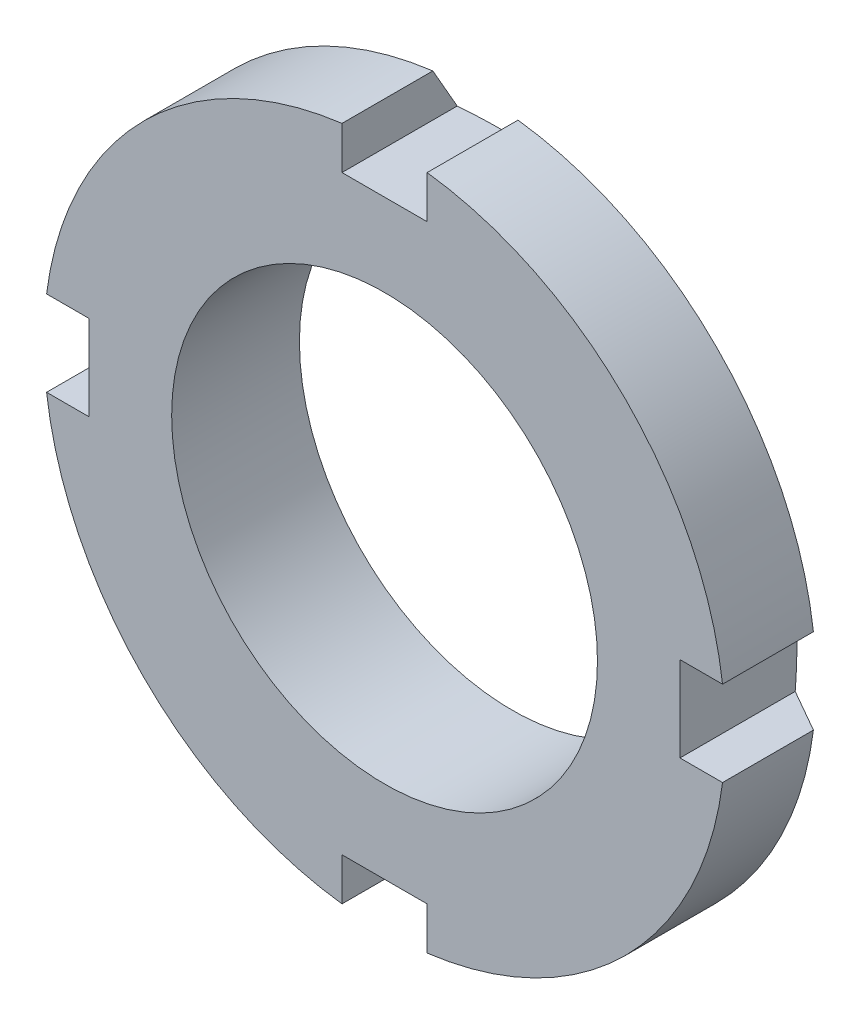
ISO-10303-21;
HEADER;
FILE_DESCRIPTION(('STEP AP214'),'2;1');
FILE_NAME('part.step','',(''),(''),'','','');
FILE_SCHEMA(('AUTOMOTIVE_DESIGN { 1 0 10303 214 1 1 1 1 }'));
ENDSEC;
DATA;
#1=APPLICATION_CONTEXT('core data for automotive mechanical design processes');
#2=APPLICATION_PROTOCOL_DEFINITION('international standard','automotive_design',2000,#1);
#3=PRODUCT_CONTEXT('',#1,'mechanical');
#4=PRODUCT('Part','Part','',(#3));
#5=PRODUCT_RELATED_PRODUCT_CATEGORY('part','',(#4));
#6=PRODUCT_DEFINITION_FORMATION('','',#4);
#7=PRODUCT_DEFINITION_CONTEXT('part definition',#1,'design');
#8=PRODUCT_DEFINITION('design','',#6,#7);
#9=PRODUCT_DEFINITION_SHAPE('','',#8);
#10=(LENGTH_UNIT() NAMED_UNIT(*) SI_UNIT(.MILLI.,.METRE.));
#11=(NAMED_UNIT(*) PLANE_ANGLE_UNIT() SI_UNIT($,.RADIAN.));
#12=(NAMED_UNIT(*) SI_UNIT($,.STERADIAN.) SOLID_ANGLE_UNIT());
#13=UNCERTAINTY_MEASURE_WITH_UNIT(LENGTH_MEASURE(1.E-05),#10,'distance_accuracy_value','');
#14=(GEOMETRIC_REPRESENTATION_CONTEXT(3) GLOBAL_UNCERTAINTY_ASSIGNED_CONTEXT((#13)) GLOBAL_UNIT_ASSIGNED_CONTEXT((#10,
#11,#12)) REPRESENTATION_CONTEXT('',''));
#15=CARTESIAN_POINT('',(0.,0.,0.));
#16=DIRECTION('',(0.,0.,1.));
#17=DIRECTION('',(1.,0.,0.));
#18=AXIS2_PLACEMENT_3D('',#15,#16,#17);
#19=CARTESIAN_POINT('',(0.,0.,0.));
#20=DIRECTION('',(0.,0.,-1.));
#21=DIRECTION('',(-1.,0.,0.));
#22=AXIS2_PLACEMENT_3D('',#19,#20,#21);
#23=CYLINDRICAL_SURFACE('',#22,16.);
#24=DIRECTION('',(0.,0.,-1.));
#25=VECTOR('',#24,1.);
#26=CARTESIAN_POINT('',(-2.,15.8745078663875,5.99999999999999));
#27=LINE('',#26,#25);
#28=CARTESIAN_POINT('',(-2.,15.8745078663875,5.99999999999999));
#29=VERTEX_POINT('',#28);
#30=CARTESIAN_POINT('',(-2.,15.8745078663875,1.73205080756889));
#31=VERTEX_POINT('',#30);
#32=EDGE_CURVE('E148',#29,#31,#27,.T.);
#33=ORIENTED_EDGE('',*,*,#32,.T.);
#34=CARTESIAN_POINT('',(0.,0.,1.73205080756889));
#35=DIRECTION('',(0.,0.,-1.));
#36=DIRECTION('',(-1.,0.,0.));
#37=AXIS2_PLACEMENT_3D('',#34,#35,#36);
#38=CIRCLE('',#37,16.);
#39=CARTESIAN_POINT('',(-15.8745078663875,2.,1.73205080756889));
#40=VERTEX_POINT('',#39);
#41=EDGE_CURVE('E185',#40,#31,#38,.T.);
#42=ORIENTED_EDGE('',*,*,#41,.F.);
#43=DIRECTION('',(0.,0.,-1.));
#44=VECTOR('',#43,1.);
#45=CARTESIAN_POINT('',(-15.8745078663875,2.,5.99999999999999));
#46=LINE('',#45,#44);
#47=CARTESIAN_POINT('',(-15.8745078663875,2.,5.99999999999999));
#48=VERTEX_POINT('',#47);
#49=EDGE_CURVE('E161',#48,#40,#46,.T.);
#50=ORIENTED_EDGE('',*,*,#49,.F.);
#51=CARTESIAN_POINT('',(0.,0.,5.99999999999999));
#52=DIRECTION('',(0.,0.,-1.));
#53=DIRECTION('',(-1.,0.,0.));
#54=AXIS2_PLACEMENT_3D('',#51,#52,#53);
#55=CIRCLE('',#54,16.);
#56=EDGE_CURVE('E168',#48,#29,#55,.T.);
#57=ORIENTED_EDGE('',*,*,#56,.T.);
#58=EDGE_LOOP('',(#33,#42,#50,#57));
#59=FACE_BOUND('',#58,.T.);
#60=ADVANCED_FACE('F32',(#59),#23,.T.);
#61=DIRECTION('',(0.,0.,-1.));
#62=VECTOR('',#61,1.);
#63=CARTESIAN_POINT('',(-15.8745078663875,-2.,5.99999999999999));
#64=LINE('',#63,#62);
#65=CARTESIAN_POINT('',(-15.8745078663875,-2.,5.99999999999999));
#66=VERTEX_POINT('',#65);
#67=CARTESIAN_POINT('',(-15.8745078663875,-2.,1.73205080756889));
#68=VERTEX_POINT('',#67);
#69=EDGE_CURVE('E339',#66,#68,#64,.T.);
#70=ORIENTED_EDGE('',*,*,#69,.T.);
#71=CARTESIAN_POINT('',(-2.,-15.8745078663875,1.73205080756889));
#72=VERTEX_POINT('',#71);
#73=EDGE_CURVE('E191',#72,#68,#38,.T.);
#74=ORIENTED_EDGE('',*,*,#73,.F.);
#75=DIRECTION('',(0.,0.,-1.));
#76=VECTOR('',#75,1.);
#77=CARTESIAN_POINT('',(-2.,-15.8745078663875,5.99999999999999));
#78=LINE('',#77,#76);
#79=CARTESIAN_POINT('',(-2.,-15.8745078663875,5.99999999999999));
#80=VERTEX_POINT('',#79);
#81=EDGE_CURVE('E313',#80,#72,#78,.T.);
#82=ORIENTED_EDGE('',*,*,#81,.F.);
#83=EDGE_CURVE('E178',#80,#66,#55,.T.);
#84=ORIENTED_EDGE('',*,*,#83,.T.);
#85=EDGE_LOOP('',(#70,#74,#82,#84));
#86=FACE_BOUND('',#85,.T.);
#87=ADVANCED_FACE('F394',(#86),#23,.T.);
#88=DIRECTION('',(0.,0.,-1.));
#89=VECTOR('',#88,1.);
#90=CARTESIAN_POINT('',(1.99999999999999,-15.8745078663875,5.99999999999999));
#91=LINE('',#90,#89);
#92=CARTESIAN_POINT('',(1.99999999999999,-15.8745078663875,5.99999999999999));
#93=VERTEX_POINT('',#92);
#94=CARTESIAN_POINT('',(2.,-15.8745078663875,1.73205080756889));
#95=VERTEX_POINT('',#94);
#96=EDGE_CURVE('E329',#93,#95,#91,.T.);
#97=ORIENTED_EDGE('',*,*,#96,.T.);
#98=CARTESIAN_POINT('',(15.8745078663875,-2.,1.73205080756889));
#99=VERTEX_POINT('',#98);
#100=EDGE_CURVE('E195',#99,#95,#38,.T.);
#101=ORIENTED_EDGE('',*,*,#100,.F.);
#102=DIRECTION('',(0.,0.,-1.));
#103=VECTOR('',#102,1.);
#104=CARTESIAN_POINT('',(15.8745078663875,-2.,5.99999999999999));
#105=LINE('',#104,#103);
#106=CARTESIAN_POINT('',(15.8745078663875,-2.,5.99999999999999));
#107=VERTEX_POINT('',#106);
#108=EDGE_CURVE('E327',#107,#99,#105,.T.);
#109=ORIENTED_EDGE('',*,*,#108,.F.);
#110=EDGE_CURVE('E182',#107,#93,#55,.T.);
#111=ORIENTED_EDGE('',*,*,#110,.T.);
#112=EDGE_LOOP('',(#97,#101,#109,#111));
#113=FACE_BOUND('',#112,.T.);
#114=ADVANCED_FACE('F326',(#113),#23,.T.);
#115=CARTESIAN_POINT('',(0.,0.,0.));
#116=DIRECTION('',(0.,0.,1.));
#117=DIRECTION('',(1.,0.,0.));
#118=AXIS2_PLACEMENT_3D('',#115,#116,#117);
#119=CONICAL_SURFACE('',#118,13.,1.0471975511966);
#120=CARTESIAN_POINT('',(-19.8478725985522,2.,4.01165169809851));
#121=CARTESIAN_POINT('',(-19.1389411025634,2.,3.60443009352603));
#122=CARTESIAN_POINT('',(-18.4299294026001,2.,3.19734788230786));
#123=CARTESIAN_POINT('',(-17.0116378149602,2.,2.3836527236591));
#124=CARTESIAN_POINT('',(-16.3023579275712,2.,1.97703977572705));
#125=CARTESIAN_POINT('',(-14.8834201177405,2.,1.16447243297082));
#126=CARTESIAN_POINT('',(-14.1737621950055,2.,0.758518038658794));
#127=CARTESIAN_POINT('',(-13.1088352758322,2.,0.150355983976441));
#128=CARTESIAN_POINT('',(-12.753786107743,2.,-0.0522365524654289));
#129=CARTESIAN_POINT('',(-12.043496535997,2.,-0.457086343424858));
#130=CARTESIAN_POINT('',(-11.6882561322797,2.,-0.659343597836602));
#131=CARTESIAN_POINT('',(-11.3328978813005,2.,-0.861393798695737));
#132=B_SPLINE_CURVE_WITH_KNOTS('',3,(#120,#121,#122,#123,#124,#125,#126,#127,#128,#129,#130,
#131),.UNSPECIFIED.,.F.,.F.,(4,2,2,2,2,4),(0.,2.45269656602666,4.90539050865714,
7.35808635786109,8.58443558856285,9.81078520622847),.UNSPECIFIED.);
#133=CARTESIAN_POINT('',(-13.8745078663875,2.,0.587694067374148));
#134=VERTEX_POINT('',#133);
#135=EDGE_CURVE('E234',#40,#134,#132,.T.);
#136=ORIENTED_EDGE('',*,*,#135,.F.);
#137=ORIENTED_EDGE('',*,*,#41,.T.);
#138=CARTESIAN_POINT('',(-2.,9.8264067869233,-1.715957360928));
#139=CARTESIAN_POINT('',(-2.,10.1821927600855,-1.51465946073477));
#140=CARTESIAN_POINT('',(-2.,10.5378027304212,-1.31305098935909));
#141=CARTESIAN_POINT('',(-2.,11.2487432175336,-0.909342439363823));
#142=CARTESIAN_POINT('',(-2.,11.604073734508,-0.70724236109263));
#143=CARTESIAN_POINT('',(-2.,12.6697542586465,-0.10039940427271));
#144=CARTESIAN_POINT('',(-2.,13.3797946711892,0.304887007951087));
#145=CARTESIAN_POINT('',(-2.,14.7993681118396,1.11634418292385));
#146=CARTESIAN_POINT('',(-2.,15.5089011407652,1.52251494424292));
#147=CARTESIAN_POINT('',(-2.,16.9276181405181,2.33546903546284));
#148=CARTESIAN_POINT('',(-2.,17.6368021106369,2.74225236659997));
#149=CARTESIAN_POINT('',(-2.,18.3458887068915,3.1492049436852));
#150=B_SPLINE_CURVE_WITH_KNOTS('',3,(#138,#139,#140,#141,#142,#143,#144,#145,#146,#147,#148,
#149),.UNSPECIFIED.,.F.,.F.,(4,2,2,2,2,4),(0.,1.22635201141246,2.4527031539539,4.90540050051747,
7.35809388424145,9.81079222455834),.UNSPECIFIED.);
#151=CARTESIAN_POINT('',(-2.,13.8745078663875,0.587694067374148));
#152=VERTEX_POINT('',#151);
#153=EDGE_CURVE('E155',#152,#31,#150,.T.);
#154=ORIENTED_EDGE('',*,*,#153,.F.);
#155=CARTESIAN_POINT('',(6.04182336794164,13.8745078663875,1.23144823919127));
#156=CARTESIAN_POINT('',(5.73063061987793,13.8745078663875,1.1597083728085));
#157=CARTESIAN_POINT('',(5.41838778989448,13.8745078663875,1.09239925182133));
#158=CARTESIAN_POINT('',(4.79189692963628,13.8745078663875,0.967500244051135));
#159=CARTESIAN_POINT('',(4.47764847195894,13.8745078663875,0.909912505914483));
#160=CARTESIAN_POINT('',(3.84704148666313,13.8745078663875,0.80529047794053));
#161=CARTESIAN_POINT('',(3.530681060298,13.8745078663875,0.758267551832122));
#162=CARTESIAN_POINT('',(2.89648649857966,13.8745078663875,0.675648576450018));
#163=CARTESIAN_POINT('',(2.57865246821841,13.8745078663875,0.640051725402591));
#164=CARTESIAN_POINT('',(1.94839121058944,13.8745078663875,0.581544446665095));
#165=CARTESIAN_POINT('',(1.6359868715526,13.8745078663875,0.558388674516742));
#166=CARTESIAN_POINT('',(1.01051204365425,13.8745078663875,0.524103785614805));
#167=CARTESIAN_POINT('',(0.697441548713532,13.8745078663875,0.512974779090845));
#168=CARTESIAN_POINT('',(0.0713288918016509,13.8745078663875,0.502967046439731));
#169=CARTESIAN_POINT('',(-0.241713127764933,13.8745078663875,0.504079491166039));
#170=CARTESIAN_POINT('',(-0.867515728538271,13.8745078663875,0.518509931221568));
#171=CARTESIAN_POINT('',(-1.18027630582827,13.8745078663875,0.531828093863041));
#172=CARTESIAN_POINT('',(-1.85622061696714,13.8745078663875,0.573574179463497));
#173=CARTESIAN_POINT('',(-2.21927454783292,13.8745078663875,0.604119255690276));
#174=CARTESIAN_POINT('',(-2.94375306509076,13.8745078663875,0.680629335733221));
#175=CARTESIAN_POINT('',(-3.30517758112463,13.8745078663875,0.726594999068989));
#176=CARTESIAN_POINT('',(-4.02634188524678,13.8745078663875,0.832945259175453));
#177=CARTESIAN_POINT('',(-4.38607903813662,13.8745078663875,0.893347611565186));
#178=CARTESIAN_POINT('',(-5.10310224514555,13.8745078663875,1.02729500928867));
#179=CARTESIAN_POINT('',(-5.460388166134,13.8745078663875,1.10084076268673));
#180=CARTESIAN_POINT('',(-6.18125690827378,13.8745078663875,1.26174599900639));
#181=CARTESIAN_POINT('',(-6.54477225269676,13.8745078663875,1.34940624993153));
#182=CARTESIAN_POINT('',(-7.26898372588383,13.8745078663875,1.53574081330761));
#183=CARTESIAN_POINT('',(-7.62967964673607,13.8745078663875,1.63441592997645));
#184=CARTESIAN_POINT('',(-8.34718971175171,13.8745078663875,1.84112295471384));
#185=CARTESIAN_POINT('',(-8.70401227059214,13.8745078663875,1.94912581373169));
#186=CARTESIAN_POINT('',(-9.41490810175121,13.8745078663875,2.17353445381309));
#187=CARTESIAN_POINT('',(-9.76898206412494,13.8745078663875,2.28993804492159));
#188=CARTESIAN_POINT('',(-10.121791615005,13.8745078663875,2.40996689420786));
#189=B_SPLINE_CURVE_WITH_KNOTS('',3,(#155,#156,#157,#158,#159,#160,#161,#162,#163,#164,#165,
#166,#167,#168,#169,#170,#171,#172,#173,#174,#175,#176,#177,#178,#179,#180,#181,#182,#183,#184,
#185,#186,#187,#188),.UNSPECIFIED.,.F.,.F.,(4,2,2,2,2,2,2,2,2,2,2,2,2,2,2,2,4),(0.,
0.958073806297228,1.9163590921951,2.87567024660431,3.83491407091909,4.77447354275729,
5.71404162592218,6.65293209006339,7.59183542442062,8.68448802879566,9.77718737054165,
10.8712375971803,11.9653467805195,13.0869589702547,14.2086531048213,15.3269719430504,
16.4450002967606),.UNSPECIFIED.);
#190=CARTESIAN_POINT('',(2.,13.8745078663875,0.587694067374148));
#191=VERTEX_POINT('',#190);
#192=EDGE_CURVE('E248',#191,#152,#189,.T.);
#193=ORIENTED_EDGE('',*,*,#192,.F.);
#194=CARTESIAN_POINT('',(2.,18.3458887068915,3.1492049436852));
#195=CARTESIAN_POINT('',(2.,17.6368021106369,2.74225236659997));
#196=CARTESIAN_POINT('',(2.,16.9276181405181,2.33546903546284));
#197=CARTESIAN_POINT('',(2.,15.5089011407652,1.52251494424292));
#198=CARTESIAN_POINT('',(2.,14.7993681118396,1.11634418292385));
#199=CARTESIAN_POINT('',(2.,13.3797946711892,0.304887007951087));
#200=CARTESIAN_POINT('',(2.,12.6697542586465,-0.10039940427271));
#201=CARTESIAN_POINT('',(2.,11.604073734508,-0.707242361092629));
#202=CARTESIAN_POINT('',(2.,11.2487432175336,-0.909342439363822));
#203=CARTESIAN_POINT('',(2.,10.5378027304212,-1.31305098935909));
#204=CARTESIAN_POINT('',(2.,10.1821927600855,-1.51465946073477));
#205=CARTESIAN_POINT('',(2.,9.8264067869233,-1.715957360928));
#206=B_SPLINE_CURVE_WITH_KNOTS('',3,(#194,#195,#196,#197,#198,#199,#200,#201,#202,#203,#204,
#205),.UNSPECIFIED.,.F.,.F.,(4,2,2,2,2,4),(0.,2.45269834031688,4.90539172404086,
7.35808907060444,8.58444021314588,9.81079222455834),.UNSPECIFIED.);
#207=CARTESIAN_POINT('',(2.,15.8745078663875,1.73205080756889));
#208=VERTEX_POINT('',#207);
#209=EDGE_CURVE('E160',#208,#191,#206,.T.);
#210=ORIENTED_EDGE('',*,*,#209,.F.);
#211=CARTESIAN_POINT('',(15.8745078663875,2.,1.73205080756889));
#212=VERTEX_POINT('',#211);
#213=EDGE_CURVE('E190',#208,#212,#38,.T.);
#214=ORIENTED_EDGE('',*,*,#213,.T.);
#215=CARTESIAN_POINT('',(9.8264067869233,2.,-1.715957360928));
#216=CARTESIAN_POINT('',(10.1821927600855,2.,-1.51465946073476));
#217=CARTESIAN_POINT('',(10.5378027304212,2.,-1.31305098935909));
#218=CARTESIAN_POINT('',(11.2487432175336,2.,-0.909342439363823));
#219=CARTESIAN_POINT('',(11.604073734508,2.,-0.70724236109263));
#220=CARTESIAN_POINT('',(12.6697542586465,2.,-0.100399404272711));
#221=CARTESIAN_POINT('',(13.3797946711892,2.,0.304887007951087));
#222=CARTESIAN_POINT('',(14.7993681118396,2.,1.11634418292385));
#223=CARTESIAN_POINT('',(15.5089011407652,2.,1.52251494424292));
#224=CARTESIAN_POINT('',(16.9276181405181,2.,2.33546903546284));
#225=CARTESIAN_POINT('',(17.6368021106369,2.,2.74225236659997));
#226=CARTESIAN_POINT('',(18.3458887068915,2.,3.1492049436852));
#227=B_SPLINE_CURVE_WITH_KNOTS('',3,(#215,#216,#217,#218,#219,#220,#221,#222,#223,#224,#225,
#226),.UNSPECIFIED.,.F.,.F.,(4,2,2,2,2,4),(0.,1.22635201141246,2.4527031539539,4.90540050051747,
7.35809388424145,9.81079222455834),.UNSPECIFIED.);
#228=CARTESIAN_POINT('',(13.8745078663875,2.,0.587694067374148));
#229=VERTEX_POINT('',#228);
#230=EDGE_CURVE('E274',#229,#212,#227,.T.);
#231=ORIENTED_EDGE('',*,*,#230,.F.);
#232=CARTESIAN_POINT('',(13.8745078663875,-10.121791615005,2.40996689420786));
#233=CARTESIAN_POINT('',(13.8745078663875,-9.76898206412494,2.28993804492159));
#234=CARTESIAN_POINT('',(13.8745078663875,-9.41490810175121,2.17353445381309));
#235=CARTESIAN_POINT('',(13.8745078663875,-8.70401227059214,1.94912581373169));
#236=CARTESIAN_POINT('',(13.8745078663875,-8.34718971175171,1.84112295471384));
#237=CARTESIAN_POINT('',(13.8745078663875,-7.62967964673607,1.63441592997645));
#238=CARTESIAN_POINT('',(13.8745078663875,-7.26898372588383,1.53574081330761));
#239=CARTESIAN_POINT('',(13.8745078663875,-6.54477225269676,1.34940624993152));
#240=CARTESIAN_POINT('',(13.8745078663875,-6.18125690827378,1.26174599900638));
#241=CARTESIAN_POINT('',(13.8745078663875,-5.460388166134,1.10084076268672));
#242=CARTESIAN_POINT('',(13.8745078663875,-5.10310224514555,1.02729500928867));
#243=CARTESIAN_POINT('',(13.8745078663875,-4.38607903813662,0.893347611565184));
#244=CARTESIAN_POINT('',(13.8745078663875,-4.02634188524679,0.832945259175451));
#245=CARTESIAN_POINT('',(13.8745078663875,-3.30517758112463,0.726594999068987));
#246=CARTESIAN_POINT('',(13.8745078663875,-2.94375306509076,0.680629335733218));
#247=CARTESIAN_POINT('',(13.8745078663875,-2.21927454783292,0.604119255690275));
#248=CARTESIAN_POINT('',(13.8745078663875,-1.85622061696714,0.573574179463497));
#249=CARTESIAN_POINT('',(13.8745078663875,-1.18027630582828,0.531828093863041));
#250=CARTESIAN_POINT('',(13.8745078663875,-0.867515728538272,0.518509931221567));
#251=CARTESIAN_POINT('',(13.8745078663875,-0.241713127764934,0.504079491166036));
#252=CARTESIAN_POINT('',(13.8745078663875,0.0713288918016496,0.502967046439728));
#253=CARTESIAN_POINT('',(13.8745078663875,0.697441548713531,0.512974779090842));
#254=CARTESIAN_POINT('',(13.8745078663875,1.01051204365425,0.524103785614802));
#255=CARTESIAN_POINT('',(13.8745078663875,1.6359868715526,0.558388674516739));
#256=CARTESIAN_POINT('',(13.8745078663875,1.94839121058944,0.581544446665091));
#257=CARTESIAN_POINT('',(13.8745078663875,2.57865246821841,0.640051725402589));
#258=CARTESIAN_POINT('',(13.8745078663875,2.89648649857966,0.675648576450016));
#259=CARTESIAN_POINT('',(13.8745078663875,3.530681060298,0.75826755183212));
#260=CARTESIAN_POINT('',(13.8745078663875,3.84704148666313,0.805290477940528));
#261=CARTESIAN_POINT('',(13.8745078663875,4.47764847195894,0.90991250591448));
#262=CARTESIAN_POINT('',(13.8745078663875,4.79189692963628,0.967500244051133));
#263=CARTESIAN_POINT('',(13.8745078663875,5.41838778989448,1.09239925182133));
#264=CARTESIAN_POINT('',(13.8745078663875,5.73063061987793,1.1597083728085));
#265=CARTESIAN_POINT('',(13.8745078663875,6.04182336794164,1.23144823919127));
#266=B_SPLINE_CURVE_WITH_KNOTS('',3,(#232,#233,#234,#235,#236,#237,#238,#239,#240,#241,#242,
#243,#244,#245,#246,#247,#248,#249,#250,#251,#252,#253,#254,#255,#256,#257,#258,#259,#260,#261,
#262,#263,#264,#265),.UNSPECIFIED.,.F.,.F.,(4,2,2,2,2,2,2,2,2,2,2,2,2,2,2,2,4),(0.,
1.11802835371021,2.23634719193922,3.35804132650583,4.47965351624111,5.5737626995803,
6.66781292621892,7.7605122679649,8.85316487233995,9.79206820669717,10.7309586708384,
11.6705267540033,12.6100862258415,13.5693300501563,14.5286412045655,15.4869264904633,
16.4450002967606),.UNSPECIFIED.);
#267=CARTESIAN_POINT('',(13.8745078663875,-2.,0.587694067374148));
#268=VERTEX_POINT('',#267);
#269=EDGE_CURVE('E206',#268,#229,#266,.T.);
#270=ORIENTED_EDGE('',*,*,#269,.F.);
#271=CARTESIAN_POINT('',(18.3458887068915,-2.,3.1492049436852));
#272=CARTESIAN_POINT('',(17.6368021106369,-2.,2.74225236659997));
#273=CARTESIAN_POINT('',(16.9276181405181,-2.,2.33546903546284));
#274=CARTESIAN_POINT('',(15.5089011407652,-2.,1.52251494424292));
#275=CARTESIAN_POINT('',(14.7993681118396,-2.,1.11634418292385));
#276=CARTESIAN_POINT('',(13.3797946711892,-2.,0.304887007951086));
#277=CARTESIAN_POINT('',(12.6697542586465,-2.,-0.10039940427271));
#278=CARTESIAN_POINT('',(11.604073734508,-2.,-0.707242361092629));
#279=CARTESIAN_POINT('',(11.2487432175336,-2.,-0.909342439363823));
#280=CARTESIAN_POINT('',(10.5378027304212,-2.,-1.31305098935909));
#281=CARTESIAN_POINT('',(10.1821927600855,-2.,-1.51465946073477));
#282=CARTESIAN_POINT('',(9.8264067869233,-2.,-1.715957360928));
#283=B_SPLINE_CURVE_WITH_KNOTS('',3,(#271,#272,#273,#274,#275,#276,#277,#278,#279,#280,#281,
#282),.UNSPECIFIED.,.F.,.F.,(4,2,2,2,2,4),(0.,2.45269834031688,4.90539172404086,
7.35808907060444,8.58444021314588,9.81079222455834),.UNSPECIFIED.);
#284=EDGE_CURVE('E280',#99,#268,#283,.T.);
#285=ORIENTED_EDGE('',*,*,#284,.F.);
#286=ORIENTED_EDGE('',*,*,#100,.T.);
#287=CARTESIAN_POINT('',(2.,-11.3328978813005,-0.861393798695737));
#288=CARTESIAN_POINT('',(2.,-11.6882561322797,-0.659343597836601));
#289=CARTESIAN_POINT('',(2.,-12.043496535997,-0.457086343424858));
#290=CARTESIAN_POINT('',(2.,-12.753786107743,-0.0522365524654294));
#291=CARTESIAN_POINT('',(2.,-13.1088352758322,0.15035598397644));
#292=CARTESIAN_POINT('',(2.,-14.1737621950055,0.758518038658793));
#293=CARTESIAN_POINT('',(2.,-14.8834201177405,1.16447243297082));
#294=CARTESIAN_POINT('',(2.,-16.3023579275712,1.97703977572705));
#295=CARTESIAN_POINT('',(2.,-17.0116378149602,2.3836527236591));
#296=CARTESIAN_POINT('',(2.,-18.4299294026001,3.19734788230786));
#297=CARTESIAN_POINT('',(2.,-19.1389411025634,3.60443009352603));
#298=CARTESIAN_POINT('',(2.,-19.8478725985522,4.01165169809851));
#299=B_SPLINE_CURVE_WITH_KNOTS('',3,(#287,#288,#289,#290,#291,#292,#293,#294,#295,#296,#297,
#298),.UNSPECIFIED.,.F.,.F.,(4,2,2,2,2,4),(0.,1.22634961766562,2.45269884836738,
4.90539469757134,7.35808864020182,9.81078520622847),.UNSPECIFIED.);
#300=CARTESIAN_POINT('',(2.,-13.8745078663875,0.587694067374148));
#301=VERTEX_POINT('',#300);
#302=EDGE_CURVE('E56',#301,#95,#299,.T.);
#303=ORIENTED_EDGE('',*,*,#302,.F.);
#304=CARTESIAN_POINT('',(-10.121791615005,-13.8745078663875,2.40996689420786));
#305=CARTESIAN_POINT('',(-9.76898206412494,-13.8745078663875,2.28993804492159));
#306=CARTESIAN_POINT('',(-9.41490810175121,-13.8745078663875,2.17353445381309));
#307=CARTESIAN_POINT('',(-8.70401227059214,-13.8745078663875,1.94912581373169));
#308=CARTESIAN_POINT('',(-8.34718971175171,-13.8745078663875,1.84112295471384));
#309=CARTESIAN_POINT('',(-7.62967964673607,-13.8745078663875,1.63441592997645));
#310=CARTESIAN_POINT('',(-7.26898372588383,-13.8745078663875,1.53574081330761));
#311=CARTESIAN_POINT('',(-6.54477225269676,-13.8745078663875,1.34940624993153));
#312=CARTESIAN_POINT('',(-6.18125690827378,-13.8745078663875,1.26174599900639));
#313=CARTESIAN_POINT('',(-5.460388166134,-13.8745078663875,1.10084076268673));
#314=CARTESIAN_POINT('',(-5.10310224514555,-13.8745078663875,1.02729500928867));
#315=CARTESIAN_POINT('',(-4.38607903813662,-13.8745078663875,0.893347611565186));
#316=CARTESIAN_POINT('',(-4.02634188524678,-13.8745078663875,0.832945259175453));
#317=CARTESIAN_POINT('',(-3.30517758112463,-13.8745078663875,0.726594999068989));
#318=CARTESIAN_POINT('',(-2.94375306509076,-13.8745078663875,0.680629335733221));
#319=CARTESIAN_POINT('',(-2.21927454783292,-13.8745078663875,0.604119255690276));
#320=CARTESIAN_POINT('',(-1.85622061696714,-13.8745078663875,0.573574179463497));
#321=CARTESIAN_POINT('',(-1.18027630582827,-13.8745078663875,0.531828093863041));
#322=CARTESIAN_POINT('',(-0.867515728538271,-13.8745078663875,0.518509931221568));
#323=CARTESIAN_POINT('',(-0.241713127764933,-13.8745078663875,0.504079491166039));
#324=CARTESIAN_POINT('',(0.071328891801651,-13.8745078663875,0.502967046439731));
#325=CARTESIAN_POINT('',(0.697441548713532,-13.8745078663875,0.512974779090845));
#326=CARTESIAN_POINT('',(1.01051204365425,-13.8745078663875,0.524103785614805));
#327=CARTESIAN_POINT('',(1.6359868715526,-13.8745078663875,0.558388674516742));
#328=CARTESIAN_POINT('',(1.94839121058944,-13.8745078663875,0.581544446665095));
#329=CARTESIAN_POINT('',(2.57865246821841,-13.8745078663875,0.640051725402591));
#330=CARTESIAN_POINT('',(2.89648649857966,-13.8745078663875,0.675648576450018));
#331=CARTESIAN_POINT('',(3.530681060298,-13.8745078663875,0.758267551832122));
#332=CARTESIAN_POINT('',(3.84704148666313,-13.8745078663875,0.80529047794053));
#333=CARTESIAN_POINT('',(4.47764847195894,-13.8745078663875,0.909912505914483));
#334=CARTESIAN_POINT('',(4.79189692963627,-13.8745078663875,0.967500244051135));
#335=CARTESIAN_POINT('',(5.41838778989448,-13.8745078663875,1.09239925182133));
#336=CARTESIAN_POINT('',(5.73063061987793,-13.8745078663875,1.1597083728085));
#337=CARTESIAN_POINT('',(6.04182336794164,-13.8745078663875,1.23144823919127));
#338=B_SPLINE_CURVE_WITH_KNOTS('',3,(#304,#305,#306,#307,#308,#309,#310,#311,#312,#313,#314,
#315,#316,#317,#318,#319,#320,#321,#322,#323,#324,#325,#326,#327,#328,#329,#330,#331,#332,#333,
#334,#335,#336,#337),.UNSPECIFIED.,.F.,.F.,(4,2,2,2,2,2,2,2,2,2,2,2,2,2,2,2,4),(0.,
1.11802835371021,2.23634719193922,3.35804132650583,4.47965351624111,5.5737626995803,
6.66781292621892,7.7605122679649,8.85316487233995,9.79206820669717,10.7309586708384,
11.6705267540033,12.6100862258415,13.5693300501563,14.5286412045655,15.4869264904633,
16.4450002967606),.UNSPECIFIED.);
#339=CARTESIAN_POINT('',(-2.,-13.8745078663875,0.587694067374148));
#340=VERTEX_POINT('',#339);
#341=EDGE_CURVE('E202',#340,#301,#338,.T.);
#342=ORIENTED_EDGE('',*,*,#341,.F.);
#343=CARTESIAN_POINT('',(-2.,-19.8478725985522,4.01165169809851));
#344=CARTESIAN_POINT('',(-2.,-19.1389411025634,3.60443009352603));
#345=CARTESIAN_POINT('',(-2.,-18.4299294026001,3.19734788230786));
#346=CARTESIAN_POINT('',(-2.,-17.0116378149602,2.3836527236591));
#347=CARTESIAN_POINT('',(-2.,-16.3023579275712,1.97703977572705));
#348=CARTESIAN_POINT('',(-2.,-14.8834201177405,1.16447243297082));
#349=CARTESIAN_POINT('',(-2.,-14.1737621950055,0.758518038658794));
#350=CARTESIAN_POINT('',(-2.,-13.1088352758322,0.150355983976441));
#351=CARTESIAN_POINT('',(-2.,-12.753786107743,-0.052236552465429));
#352=CARTESIAN_POINT('',(-2.,-12.043496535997,-0.457086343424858));
#353=CARTESIAN_POINT('',(-2.,-11.6882561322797,-0.659343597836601));
#354=CARTESIAN_POINT('',(-2.,-11.3328978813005,-0.861393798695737));
#355=B_SPLINE_CURVE_WITH_KNOTS('',3,(#343,#344,#345,#346,#347,#348,#349,#350,#351,#352,#353,
#354),.UNSPECIFIED.,.F.,.F.,(4,2,2,2,2,4),(0.,2.45269656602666,4.90539050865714,
7.35808635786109,8.58443558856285,9.81078520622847),.UNSPECIFIED.);
#356=EDGE_CURVE('E306',#72,#340,#355,.T.);
#357=ORIENTED_EDGE('',*,*,#356,.F.);
#358=ORIENTED_EDGE('',*,*,#73,.T.);
#359=CARTESIAN_POINT('',(-11.3328978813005,-2.,-0.861393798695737));
#360=CARTESIAN_POINT('',(-11.6882561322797,-2.,-0.659343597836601));
#361=CARTESIAN_POINT('',(-12.043496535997,-2.,-0.457086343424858));
#362=CARTESIAN_POINT('',(-12.753786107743,-2.,-0.0522365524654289));
#363=CARTESIAN_POINT('',(-13.1088352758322,-2.,0.150355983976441));
#364=CARTESIAN_POINT('',(-14.1737621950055,-2.,0.758518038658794));
#365=CARTESIAN_POINT('',(-14.8834201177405,-2.,1.16447243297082));
#366=CARTESIAN_POINT('',(-16.3023579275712,-2.,1.97703977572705));
#367=CARTESIAN_POINT('',(-17.0116378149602,-2.,2.3836527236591));
#368=CARTESIAN_POINT('',(-18.4299294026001,-2.,3.19734788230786));
#369=CARTESIAN_POINT('',(-19.1389411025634,-2.,3.60443009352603));
#370=CARTESIAN_POINT('',(-19.8478725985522,-2.,4.01165169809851));
#371=B_SPLINE_CURVE_WITH_KNOTS('',3,(#359,#360,#361,#362,#363,#364,#365,#366,#367,#368,#369,
#370),.UNSPECIFIED.,.F.,.F.,(4,2,2,2,2,4),(0.,1.22634961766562,2.45269884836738,
4.90539469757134,7.35808864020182,9.81078520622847),.UNSPECIFIED.);
#372=CARTESIAN_POINT('',(-13.8745078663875,-2.,0.587694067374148));
#373=VERTEX_POINT('',#372);
#374=EDGE_CURVE('E48',#373,#68,#371,.T.);
#375=ORIENTED_EDGE('',*,*,#374,.F.);
#376=CARTESIAN_POINT('',(-13.8745078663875,6.04182336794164,1.23144823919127));
#377=CARTESIAN_POINT('',(-13.8745078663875,5.73063061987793,1.1597083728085));
#378=CARTESIAN_POINT('',(-13.8745078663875,5.41838778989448,1.09239925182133));
#379=CARTESIAN_POINT('',(-13.8745078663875,4.79189692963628,0.967500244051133));
#380=CARTESIAN_POINT('',(-13.8745078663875,4.47764847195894,0.90991250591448));
#381=CARTESIAN_POINT('',(-13.8745078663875,3.84704148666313,0.805290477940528));
#382=CARTESIAN_POINT('',(-13.8745078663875,3.530681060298,0.75826755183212));
#383=CARTESIAN_POINT('',(-13.8745078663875,2.89648649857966,0.675648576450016));
#384=CARTESIAN_POINT('',(-13.8745078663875,2.57865246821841,0.640051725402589));
#385=CARTESIAN_POINT('',(-13.8745078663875,1.94839121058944,0.581544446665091));
#386=CARTESIAN_POINT('',(-13.8745078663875,1.6359868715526,0.558388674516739));
#387=CARTESIAN_POINT('',(-13.8745078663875,1.01051204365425,0.524103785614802));
#388=CARTESIAN_POINT('',(-13.8745078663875,0.697441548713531,0.512974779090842));
#389=CARTESIAN_POINT('',(-13.8745078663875,0.0713288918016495,0.502967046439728));
#390=CARTESIAN_POINT('',(-13.8745078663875,-0.241713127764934,0.504079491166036));
#391=CARTESIAN_POINT('',(-13.8745078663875,-0.867515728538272,0.518509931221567));
#392=CARTESIAN_POINT('',(-13.8745078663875,-1.18027630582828,0.531828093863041));
#393=CARTESIAN_POINT('',(-13.8745078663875,-1.85622061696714,0.573574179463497));
#394=CARTESIAN_POINT('',(-13.8745078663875,-2.21927454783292,0.604119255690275));
#395=CARTESIAN_POINT('',(-13.8745078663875,-2.94375306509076,0.680629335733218));
#396=CARTESIAN_POINT('',(-13.8745078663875,-3.30517758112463,0.726594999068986));
#397=CARTESIAN_POINT('',(-13.8745078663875,-4.02634188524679,0.83294525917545));
#398=CARTESIAN_POINT('',(-13.8745078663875,-4.38607903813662,0.893347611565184));
#399=CARTESIAN_POINT('',(-13.8745078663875,-5.10310224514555,1.02729500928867));
#400=CARTESIAN_POINT('',(-13.8745078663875,-5.460388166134,1.10084076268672));
#401=CARTESIAN_POINT('',(-13.8745078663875,-6.18125690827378,1.26174599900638));
#402=CARTESIAN_POINT('',(-13.8745078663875,-6.54477225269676,1.34940624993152));
#403=CARTESIAN_POINT('',(-13.8745078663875,-7.26898372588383,1.5357408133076));
#404=CARTESIAN_POINT('',(-13.8745078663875,-7.62967964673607,1.63441592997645));
#405=CARTESIAN_POINT('',(-13.8745078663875,-8.34718971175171,1.84112295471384));
#406=CARTESIAN_POINT('',(-13.8745078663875,-8.70401227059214,1.94912581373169));
#407=CARTESIAN_POINT('',(-13.8745078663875,-9.41490810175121,2.17353445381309));
#408=CARTESIAN_POINT('',(-13.8745078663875,-9.76898206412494,2.28993804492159));
#409=CARTESIAN_POINT('',(-13.8745078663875,-10.121791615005,2.40996689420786));
#410=B_SPLINE_CURVE_WITH_KNOTS('',3,(#376,#377,#378,#379,#380,#381,#382,#383,#384,#385,#386,
#387,#388,#389,#390,#391,#392,#393,#394,#395,#396,#397,#398,#399,#400,#401,#402,#403,#404,#405,
#406,#407,#408,#409),.UNSPECIFIED.,.F.,.F.,(4,2,2,2,2,2,2,2,2,2,2,2,2,2,2,2,4),(0.,
0.958073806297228,1.9163590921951,2.87567024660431,3.83491407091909,4.77447354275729,
5.71404162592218,6.6529320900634,7.59183542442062,8.68448802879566,9.77718737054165,
10.8712375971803,11.9653467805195,13.0869589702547,14.2086531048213,15.3269719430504,
16.4450002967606),.UNSPECIFIED.);
#411=EDGE_CURVE('E198',#134,#373,#410,.T.);
#412=ORIENTED_EDGE('',*,*,#411,.F.);
#413=EDGE_LOOP('',(#136,#137,#154,#193,#210,#214,#231,#270,#285,#286,#303,#342,#357,#358,#375,#412));
#414=FACE_BOUND('',#413,.T.);
#415=CARTESIAN_POINT('',(0.,0.,0.));
#416=DIRECTION('',(0.,0.,-1.));
#417=DIRECTION('',(-1.,0.,0.));
#418=AXIS2_PLACEMENT_3D('',#415,#416,#417);
#419=CIRCLE('',#418,13.);
#420=CARTESIAN_POINT('',(-13.,0.,0.));
#421=VERTEX_POINT('',#420);
#422=EDGE_CURVE('E12',#421,#421,#419,.T.);
#423=ORIENTED_EDGE('',*,*,#422,.F.);
#424=EDGE_LOOP('',(#423));
#425=FACE_BOUND('',#424,.T.);
#426=ADVANCED_FACE('F34',(#414,#425),#119,.T.);
#427=CARTESIAN_POINT('',(0.,10.,0.));
#428=DIRECTION('',(0.,0.,-1.));
#429=DIRECTION('',(-1.,0.,0.));
#430=AXIS2_PLACEMENT_3D('',#427,#428,#429);
#431=PLANE('',#430);
#432=ORIENTED_EDGE('',*,*,#422,.T.);
#433=EDGE_LOOP('',(#432));
#434=FACE_BOUND('',#433,.T.);
#435=CARTESIAN_POINT('',(0.,0.,0.));
#436=DIRECTION('',(0.,0.,-1.));
#437=DIRECTION('',(-1.,0.,0.));
#438=AXIS2_PLACEMENT_3D('',#435,#436,#437);
#439=CIRCLE('',#438,10.);
#440=CARTESIAN_POINT('',(-10.,0.,0.));
#441=VERTEX_POINT('',#440);
#442=EDGE_CURVE('E41',#441,#441,#439,.T.);
#443=ORIENTED_EDGE('',*,*,#442,.F.);
#444=EDGE_LOOP('',(#443));
#445=FACE_BOUND('',#444,.T.);
#446=ADVANCED_FACE('F414',(#434,#445),#431,.T.);
#447=CARTESIAN_POINT('',(0.,0.,0.));
#448=DIRECTION('',(0.,0.,-1.));
#449=DIRECTION('',(-1.,0.,0.));
#450=AXIS2_PLACEMENT_3D('',#447,#448,#449);
#451=CYLINDRICAL_SURFACE('',#450,10.);
#452=ORIENTED_EDGE('',*,*,#442,.T.);
#453=EDGE_LOOP('',(#452));
#454=FACE_BOUND('',#453,.T.);
#455=CARTESIAN_POINT('',(0.,0.,5.99999999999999));
#456=DIRECTION('',(0.,0.,-1.));
#457=DIRECTION('',(-1.,0.,0.));
#458=AXIS2_PLACEMENT_3D('',#455,#456,#457);
#459=CIRCLE('',#458,10.);
#460=CARTESIAN_POINT('',(-10.,0.,5.99999999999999));
#461=VERTEX_POINT('',#460);
#462=EDGE_CURVE('E175',#461,#461,#459,.T.);
#463=ORIENTED_EDGE('',*,*,#462,.F.);
#464=EDGE_LOOP('',(#463));
#465=FACE_BOUND('',#464,.T.);
#466=ADVANCED_FACE('F409',(#454,#465),#451,.F.);
#467=CARTESIAN_POINT('',(0.,16.,5.99999999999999));
#468=DIRECTION('',(0.,0.,1.));
#469=DIRECTION('',(1.,0.,0.));
#470=AXIS2_PLACEMENT_3D('',#467,#468,#469);
#471=PLANE('',#470);
#472=DIRECTION('',(1.,0.,0.));
#473=VECTOR('',#472,1.);
#474=CARTESIAN_POINT('',(-13.8745078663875,2.,5.99999999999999));
#475=LINE('',#474,#473);
#476=CARTESIAN_POINT('',(-13.8745078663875,2.,5.99999999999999));
#477=VERTEX_POINT('',#476);
#478=EDGE_CURVE('E172',#48,#477,#475,.T.);
#479=ORIENTED_EDGE('',*,*,#478,.T.);
#480=DIRECTION('',(0.,-1.,0.));
#481=VECTOR('',#480,1.);
#482=CARTESIAN_POINT('',(-13.8745078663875,2.,5.99999999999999));
#483=LINE('',#482,#481);
#484=CARTESIAN_POINT('',(-13.8745078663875,-2.,5.99999999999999));
#485=VERTEX_POINT('',#484);
#486=EDGE_CURVE('E346',#477,#485,#483,.T.);
#487=ORIENTED_EDGE('',*,*,#486,.T.);
#488=DIRECTION('',(-1.,0.,0.));
#489=VECTOR('',#488,1.);
#490=CARTESIAN_POINT('',(-13.8745078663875,-2.,5.99999999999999));
#491=LINE('',#490,#489);
#492=EDGE_CURVE('E348',#485,#66,#491,.T.);
#493=ORIENTED_EDGE('',*,*,#492,.T.);
#494=ORIENTED_EDGE('',*,*,#83,.F.);
#495=DIRECTION('',(0.,1.,0.));
#496=VECTOR('',#495,1.);
#497=CARTESIAN_POINT('',(-2.,-13.8745078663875,5.99999999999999));
#498=LINE('',#497,#496);
#499=CARTESIAN_POINT('',(-2.,-13.8745078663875,5.99999999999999));
#500=VERTEX_POINT('',#499);
#501=EDGE_CURVE('E353',#80,#500,#498,.T.);
#502=ORIENTED_EDGE('',*,*,#501,.T.);
#503=DIRECTION('',(1.,0.,0.));
#504=VECTOR('',#503,1.);
#505=CARTESIAN_POINT('',(-2.,-13.8745078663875,5.99999999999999));
#506=LINE('',#505,#504);
#507=CARTESIAN_POINT('',(2.,-13.8745078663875,5.99999999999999));
#508=VERTEX_POINT('',#507);
#509=EDGE_CURVE('E316',#500,#508,#506,.T.);
#510=ORIENTED_EDGE('',*,*,#509,.T.);
#511=DIRECTION('',(0.,-1.,0.));
#512=VECTOR('',#511,1.);
#513=CARTESIAN_POINT('',(2.,-13.8745078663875,5.99999999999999));
#514=LINE('',#513,#512);
#515=EDGE_CURVE('E356',#508,#93,#514,.T.);
#516=ORIENTED_EDGE('',*,*,#515,.T.);
#517=ORIENTED_EDGE('',*,*,#110,.F.);
#518=DIRECTION('',(-1.,0.,0.));
#519=VECTOR('',#518,1.);
#520=CARTESIAN_POINT('',(13.8745078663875,-2.,5.99999999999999));
#521=LINE('',#520,#519);
#522=CARTESIAN_POINT('',(13.8745078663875,-2.,5.99999999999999));
#523=VERTEX_POINT('',#522);
#524=EDGE_CURVE('E358',#107,#523,#521,.T.);
#525=ORIENTED_EDGE('',*,*,#524,.T.);
#526=DIRECTION('',(0.,1.,0.));
#527=VECTOR('',#526,1.);
#528=CARTESIAN_POINT('',(13.8745078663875,2.,5.99999999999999));
#529=LINE('',#528,#527);
#530=CARTESIAN_POINT('',(13.8745078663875,2.,5.99999999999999));
#531=VERTEX_POINT('',#530);
#532=EDGE_CURVE('E361',#523,#531,#529,.T.);
#533=ORIENTED_EDGE('',*,*,#532,.T.);
#534=DIRECTION('',(1.,0.,0.));
#535=VECTOR('',#534,1.);
#536=CARTESIAN_POINT('',(13.8745078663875,2.,5.99999999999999));
#537=LINE('',#536,#535);
#538=CARTESIAN_POINT('',(15.8745078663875,2.,5.99999999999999));
#539=VERTEX_POINT('',#538);
#540=EDGE_CURVE('E364',#531,#539,#537,.T.);
#541=ORIENTED_EDGE('',*,*,#540,.T.);
#542=CARTESIAN_POINT('',(2.,15.8745078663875,5.99999999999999));
#543=VERTEX_POINT('',#542);
#544=EDGE_CURVE('E176',#543,#539,#55,.T.);
#545=ORIENTED_EDGE('',*,*,#544,.F.);
#546=DIRECTION('',(0.,-1.,0.));
#547=VECTOR('',#546,1.);
#548=CARTESIAN_POINT('',(2.,13.8745078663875,5.99999999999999));
#549=LINE('',#548,#547);
#550=CARTESIAN_POINT('',(2.,13.8745078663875,5.99999999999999));
#551=VERTEX_POINT('',#550);
#552=EDGE_CURVE('E367',#543,#551,#549,.T.);
#553=ORIENTED_EDGE('',*,*,#552,.T.);
#554=DIRECTION('',(-1.,0.,0.));
#555=VECTOR('',#554,1.);
#556=CARTESIAN_POINT('',(-2.,13.8745078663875,5.99999999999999));
#557=LINE('',#556,#555);
#558=CARTESIAN_POINT('',(-2.,13.8745078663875,5.99999999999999));
#559=VERTEX_POINT('',#558);
#560=EDGE_CURVE('E171',#551,#559,#557,.T.);
#561=ORIENTED_EDGE('',*,*,#560,.T.);
#562=DIRECTION('',(0.,1.,0.));
#563=VECTOR('',#562,1.);
#564=CARTESIAN_POINT('',(-2.,13.8745078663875,5.99999999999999));
#565=LINE('',#564,#563);
#566=EDGE_CURVE('E152',#559,#29,#565,.T.);
#567=ORIENTED_EDGE('',*,*,#566,.T.);
#568=ORIENTED_EDGE('',*,*,#56,.F.);
#569=EDGE_LOOP('',(#479,#487,#493,#494,#502,#510,#516,#517,#525,#533,#541,#545,#553,#561,#567,#568));
#570=FACE_BOUND('',#569,.T.);
#571=ORIENTED_EDGE('',*,*,#462,.T.);
#572=EDGE_LOOP('',(#571));
#573=FACE_BOUND('',#572,.T.);
#574=ADVANCED_FACE('F166',(#570,#573),#471,.T.);
#575=DIRECTION('',(0.,0.,-1.));
#576=VECTOR('',#575,1.);
#577=CARTESIAN_POINT('',(15.8745078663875,2.,5.99999999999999));
#578=LINE('',#577,#576);
#579=EDGE_CURVE('E377',#539,#212,#578,.T.);
#580=ORIENTED_EDGE('',*,*,#579,.T.);
#581=ORIENTED_EDGE('',*,*,#213,.F.);
#582=DIRECTION('',(0.,0.,-1.));
#583=VECTOR('',#582,1.);
#584=CARTESIAN_POINT('',(2.,15.8745078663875,5.99999999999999));
#585=LINE('',#584,#583);
#586=EDGE_CURVE('E375',#543,#208,#585,.T.);
#587=ORIENTED_EDGE('',*,*,#586,.F.);
#588=ORIENTED_EDGE('',*,*,#544,.T.);
#589=EDGE_LOOP('',(#580,#581,#587,#588));
#590=FACE_BOUND('',#589,.T.);
#591=ADVANCED_FACE('F391',(#590),#23,.T.);
#592=CARTESIAN_POINT('',(-2.,13.8745078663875,5.99999999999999));
#593=DIRECTION('',(-1.,0.,0.));
#594=DIRECTION('',(0.,0.,1.));
#595=AXIS2_PLACEMENT_3D('',#592,#593,#594);
#596=PLANE('',#595);
#597=ORIENTED_EDGE('',*,*,#153,.T.);
#598=ORIENTED_EDGE('',*,*,#32,.F.);
#599=ORIENTED_EDGE('',*,*,#566,.F.);
#600=DIRECTION('',(0.,0.,-1.));
#601=VECTOR('',#600,1.);
#602=CARTESIAN_POINT('',(-2.,13.8745078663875,5.99999999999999));
#603=LINE('',#602,#601);
#604=EDGE_CURVE('E370',#559,#152,#603,.T.);
#605=ORIENTED_EDGE('',*,*,#604,.T.);
#606=EDGE_LOOP('',(#597,#598,#599,#605));
#607=FACE_BOUND('',#606,.T.);
#608=ADVANCED_FACE('F150',(#607),#596,.F.);
#609=CARTESIAN_POINT('',(2.,13.8745078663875,5.99999999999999));
#610=DIRECTION('',(1.,0.,0.));
#611=DIRECTION('',(0.,0.,-1.));
#612=AXIS2_PLACEMENT_3D('',#609,#610,#611);
#613=PLANE('',#612);
#614=ORIENTED_EDGE('',*,*,#209,.T.);
#615=DIRECTION('',(0.,0.,-1.));
#616=VECTOR('',#615,1.);
#617=CARTESIAN_POINT('',(2.,13.8745078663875,5.99999999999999));
#618=LINE('',#617,#616);
#619=EDGE_CURVE('E372',#551,#191,#618,.T.);
#620=ORIENTED_EDGE('',*,*,#619,.F.);
#621=ORIENTED_EDGE('',*,*,#552,.F.);
#622=ORIENTED_EDGE('',*,*,#586,.T.);
#623=EDGE_LOOP('',(#614,#620,#621,#622));
#624=FACE_BOUND('',#623,.T.);
#625=ADVANCED_FACE('F262',(#624),#613,.F.);
#626=CARTESIAN_POINT('',(-2.,13.8745078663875,5.99999999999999));
#627=DIRECTION('',(0.,-1.,0.));
#628=DIRECTION('',(0.,0.,-1.));
#629=AXIS2_PLACEMENT_3D('',#626,#627,#628);
#630=PLANE('',#629);
#631=ORIENTED_EDGE('',*,*,#192,.T.);
#632=ORIENTED_EDGE('',*,*,#604,.F.);
#633=ORIENTED_EDGE('',*,*,#560,.F.);
#634=ORIENTED_EDGE('',*,*,#619,.T.);
#635=EDGE_LOOP('',(#631,#632,#633,#634));
#636=FACE_BOUND('',#635,.T.);
#637=ADVANCED_FACE('F257',(#636),#630,.F.);
#638=CARTESIAN_POINT('',(13.8745078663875,2.,5.99999999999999));
#639=DIRECTION('',(0.,1.,0.));
#640=DIRECTION('',(0.,0.,1.));
#641=AXIS2_PLACEMENT_3D('',#638,#639,#640);
#642=PLANE('',#641);
#643=ORIENTED_EDGE('',*,*,#230,.T.);
#644=ORIENTED_EDGE('',*,*,#579,.F.);
#645=ORIENTED_EDGE('',*,*,#540,.F.);
#646=DIRECTION('',(0.,0.,-1.));
#647=VECTOR('',#646,1.);
#648=CARTESIAN_POINT('',(13.8745078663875,2.,5.99999999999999));
#649=LINE('',#648,#647);
#650=EDGE_CURVE('E380',#531,#229,#649,.T.);
#651=ORIENTED_EDGE('',*,*,#650,.T.);
#652=EDGE_LOOP('',(#643,#644,#645,#651));
#653=FACE_BOUND('',#652,.T.);
#654=ADVANCED_FACE('F261',(#653),#642,.F.);
#655=CARTESIAN_POINT('',(13.8745078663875,-2.,5.99999999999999));
#656=DIRECTION('',(0.,-1.,0.));
#657=DIRECTION('',(0.,0.,-1.));
#658=AXIS2_PLACEMENT_3D('',#655,#656,#657);
#659=PLANE('',#658);
#660=ORIENTED_EDGE('',*,*,#284,.T.);
#661=DIRECTION('',(0.,0.,-1.));
#662=VECTOR('',#661,1.);
#663=CARTESIAN_POINT('',(13.8745078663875,-2.,5.99999999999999));
#664=LINE('',#663,#662);
#665=EDGE_CURVE('E334',#523,#268,#664,.T.);
#666=ORIENTED_EDGE('',*,*,#665,.F.);
#667=ORIENTED_EDGE('',*,*,#524,.F.);
#668=ORIENTED_EDGE('',*,*,#108,.T.);
#669=EDGE_LOOP('',(#660,#666,#667,#668));
#670=FACE_BOUND('',#669,.T.);
#671=ADVANCED_FACE('F290',(#670),#659,.F.);
#672=CARTESIAN_POINT('',(13.8745078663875,2.,5.99999999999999));
#673=DIRECTION('',(-1.,0.,0.));
#674=DIRECTION('',(0.,0.,1.));
#675=AXIS2_PLACEMENT_3D('',#672,#673,#674);
#676=PLANE('',#675);
#677=ORIENTED_EDGE('',*,*,#269,.T.);
#678=ORIENTED_EDGE('',*,*,#650,.F.);
#679=ORIENTED_EDGE('',*,*,#532,.F.);
#680=ORIENTED_EDGE('',*,*,#665,.T.);
#681=EDGE_LOOP('',(#677,#678,#679,#680));
#682=FACE_BOUND('',#681,.T.);
#683=ADVANCED_FACE('F293',(#682),#676,.F.);
#684=CARTESIAN_POINT('',(2.,-13.8745078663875,5.99999999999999));
#685=DIRECTION('',(1.,0.,0.));
#686=DIRECTION('',(0.,0.,-1.));
#687=AXIS2_PLACEMENT_3D('',#684,#685,#686);
#688=PLANE('',#687);
#689=ORIENTED_EDGE('',*,*,#302,.T.);
#690=ORIENTED_EDGE('',*,*,#96,.F.);
#691=ORIENTED_EDGE('',*,*,#515,.F.);
#692=DIRECTION('',(0.,0.,-1.));
#693=VECTOR('',#692,1.);
#694=CARTESIAN_POINT('',(2.,-13.8745078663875,5.99999999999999));
#695=LINE('',#694,#693);
#696=EDGE_CURVE('E318',#508,#301,#695,.T.);
#697=ORIENTED_EDGE('',*,*,#696,.T.);
#698=EDGE_LOOP('',(#689,#690,#691,#697));
#699=FACE_BOUND('',#698,.T.);
#700=ADVANCED_FACE('F296',(#699),#688,.F.);
#701=CARTESIAN_POINT('',(-2.,-13.8745078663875,5.99999999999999));
#702=DIRECTION('',(-1.,0.,0.));
#703=DIRECTION('',(0.,0.,1.));
#704=AXIS2_PLACEMENT_3D('',#701,#702,#703);
#705=PLANE('',#704);
#706=ORIENTED_EDGE('',*,*,#356,.T.);
#707=DIRECTION('',(0.,0.,-1.));
#708=VECTOR('',#707,1.);
#709=CARTESIAN_POINT('',(-2.,-13.8745078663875,5.99999999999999));
#710=LINE('',#709,#708);
#711=EDGE_CURVE('E311',#500,#340,#710,.T.);
#712=ORIENTED_EDGE('',*,*,#711,.F.);
#713=ORIENTED_EDGE('',*,*,#501,.F.);
#714=ORIENTED_EDGE('',*,*,#81,.T.);
#715=EDGE_LOOP('',(#706,#712,#713,#714));
#716=FACE_BOUND('',#715,.T.);
#717=ADVANCED_FACE('F299',(#716),#705,.F.);
#718=CARTESIAN_POINT('',(-2.,-13.8745078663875,5.99999999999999));
#719=DIRECTION('',(0.,1.,0.));
#720=DIRECTION('',(0.,0.,1.));
#721=AXIS2_PLACEMENT_3D('',#718,#719,#720);
#722=PLANE('',#721);
#723=ORIENTED_EDGE('',*,*,#341,.T.);
#724=ORIENTED_EDGE('',*,*,#696,.F.);
#725=ORIENTED_EDGE('',*,*,#509,.F.);
#726=ORIENTED_EDGE('',*,*,#711,.T.);
#727=EDGE_LOOP('',(#723,#724,#725,#726));
#728=FACE_BOUND('',#727,.T.);
#729=ADVANCED_FACE('F229',(#728),#722,.F.);
#730=CARTESIAN_POINT('',(-13.8745078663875,2.,5.99999999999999));
#731=DIRECTION('',(0.,1.,0.));
#732=DIRECTION('',(0.,0.,1.));
#733=AXIS2_PLACEMENT_3D('',#730,#731,#732);
#734=PLANE('',#733);
#735=ORIENTED_EDGE('',*,*,#135,.T.);
#736=DIRECTION('',(0.,0.,-1.));
#737=VECTOR('',#736,1.);
#738=CARTESIAN_POINT('',(-13.8745078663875,2.,5.99999999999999));
#739=LINE('',#738,#737);
#740=EDGE_CURVE('E343',#477,#134,#739,.T.);
#741=ORIENTED_EDGE('',*,*,#740,.F.);
#742=ORIENTED_EDGE('',*,*,#478,.F.);
#743=ORIENTED_EDGE('',*,*,#49,.T.);
#744=EDGE_LOOP('',(#735,#741,#742,#743));
#745=FACE_BOUND('',#744,.T.);
#746=ADVANCED_FACE('F223',(#745),#734,.F.);
#747=CARTESIAN_POINT('',(-13.8745078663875,2.,5.99999999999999));
#748=DIRECTION('',(1.,0.,0.));
#749=DIRECTION('',(0.,0.,-1.));
#750=AXIS2_PLACEMENT_3D('',#747,#748,#749);
#751=PLANE('',#750);
#752=ORIENTED_EDGE('',*,*,#411,.T.);
#753=DIRECTION('',(0.,0.,-1.));
#754=VECTOR('',#753,1.);
#755=CARTESIAN_POINT('',(-13.8745078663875,-2.,5.99999999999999));
#756=LINE('',#755,#754);
#757=EDGE_CURVE('E341',#485,#373,#756,.T.);
#758=ORIENTED_EDGE('',*,*,#757,.F.);
#759=ORIENTED_EDGE('',*,*,#486,.F.);
#760=ORIENTED_EDGE('',*,*,#740,.T.);
#761=EDGE_LOOP('',(#752,#758,#759,#760));
#762=FACE_BOUND('',#761,.T.);
#763=ADVANCED_FACE('F217',(#762),#751,.F.);
#764=CARTESIAN_POINT('',(-13.8745078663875,-2.,5.99999999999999));
#765=DIRECTION('',(0.,-1.,0.));
#766=DIRECTION('',(0.,0.,-1.));
#767=AXIS2_PLACEMENT_3D('',#764,#765,#766);
#768=PLANE('',#767);
#769=ORIENTED_EDGE('',*,*,#374,.T.);
#770=ORIENTED_EDGE('',*,*,#69,.F.);
#771=ORIENTED_EDGE('',*,*,#492,.F.);
#772=ORIENTED_EDGE('',*,*,#757,.T.);
#773=EDGE_LOOP('',(#769,#770,#771,#772));
#774=FACE_BOUND('',#773,.T.);
#775=ADVANCED_FACE('F222',(#774),#768,.F.);
#776=CLOSED_SHELL('',(#60,#87,#114,#426,#446,#466,#574,#591,#608,#625,#637,#654,#671,#683,#700,
#717,#729,#746,#763,#775));
#777=MANIFOLD_SOLID_BREP('B2',#776);
#778=ADVANCED_BREP_SHAPE_REPRESENTATION('',(#18,#777),#14);
#779=SHAPE_DEFINITION_REPRESENTATION(#9,#778);
ENDSEC;
END-ISO-10303-21;
